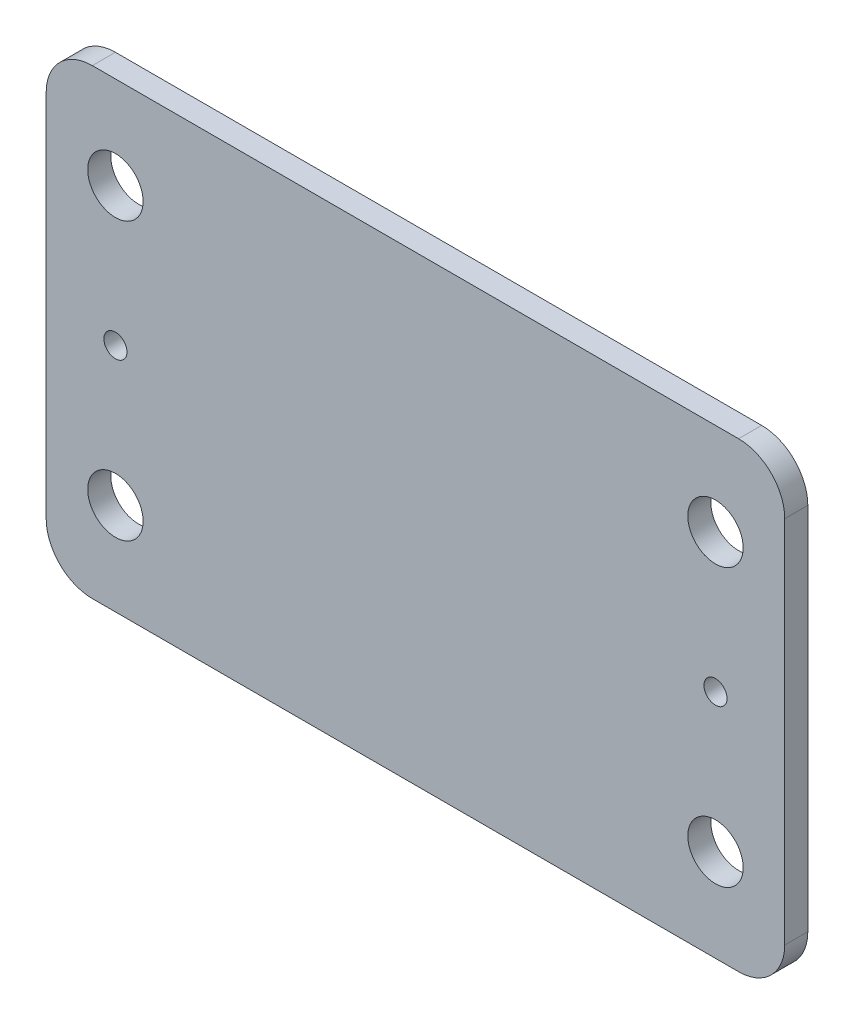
ISO-10303-21;
HEADER;
FILE_DESCRIPTION(('STEP AP214'),'2;1');
FILE_NAME('part.step','',(''),(''),'','','');
FILE_SCHEMA(('AUTOMOTIVE_DESIGN { 1 0 10303 214 1 1 1 1 }'));
ENDSEC;
DATA;
#1=APPLICATION_CONTEXT('core data for automotive mechanical design processes');
#2=APPLICATION_PROTOCOL_DEFINITION('international standard','automotive_design',2000,#1);
#3=PRODUCT_CONTEXT('',#1,'mechanical');
#4=PRODUCT('Part','Part','',(#3));
#5=PRODUCT_RELATED_PRODUCT_CATEGORY('part','',(#4));
#6=PRODUCT_DEFINITION_FORMATION('','',#4);
#7=PRODUCT_DEFINITION_CONTEXT('part definition',#1,'design');
#8=PRODUCT_DEFINITION('design','',#6,#7);
#9=PRODUCT_DEFINITION_SHAPE('','',#8);
#10=(LENGTH_UNIT() NAMED_UNIT(*) SI_UNIT(.MILLI.,.METRE.));
#11=(NAMED_UNIT(*) PLANE_ANGLE_UNIT() SI_UNIT($,.RADIAN.));
#12=(NAMED_UNIT(*) SI_UNIT($,.STERADIAN.) SOLID_ANGLE_UNIT());
#13=UNCERTAINTY_MEASURE_WITH_UNIT(LENGTH_MEASURE(1.E-05),#10,'distance_accuracy_value','');
#14=(GEOMETRIC_REPRESENTATION_CONTEXT(3) GLOBAL_UNCERTAINTY_ASSIGNED_CONTEXT((#13)) GLOBAL_UNIT_ASSIGNED_CONTEXT((#10,
#11,#12)) REPRESENTATION_CONTEXT('',''));
#15=CARTESIAN_POINT('',(0.,0.,0.));
#16=DIRECTION('',(0.,0.,1.));
#17=DIRECTION('',(1.,0.,0.));
#18=AXIS2_PLACEMENT_3D('',#15,#16,#17);
#19=CARTESIAN_POINT('',(0.,0.,5.));
#20=DIRECTION('',(1.,0.,0.));
#21=DIRECTION('',(0.,0.,-1.));
#22=AXIS2_PLACEMENT_3D('',#19,#20,#21);
#23=PLANE('',#22);
#24=DIRECTION('',(0.,-1.,0.));
#25=VECTOR('',#24,1.);
#26=CARTESIAN_POINT('',(0.,0.,0.));
#27=LINE('',#26,#25);
#28=CARTESIAN_POINT('',(0.,90.,0.));
#29=VERTEX_POINT('',#28);
#30=CARTESIAN_POINT('',(0.,10.,0.));
#31=VERTEX_POINT('',#30);
#32=EDGE_CURVE('E156',#29,#31,#27,.T.);
#33=ORIENTED_EDGE('',*,*,#32,.T.);
#34=DIRECTION('',(0.,0.,-1.));
#35=VECTOR('',#34,1.);
#36=CARTESIAN_POINT('',(0.,10.,5.));
#37=LINE('',#36,#35);
#38=CARTESIAN_POINT('',(0.,10.,5.));
#39=VERTEX_POINT('',#38);
#40=EDGE_CURVE('E131',#31,#39,#37,.F.);
#41=ORIENTED_EDGE('',*,*,#40,.T.);
#42=DIRECTION('',(0.,-1.,0.));
#43=VECTOR('',#42,1.);
#44=CARTESIAN_POINT('',(0.,0.,5.));
#45=LINE('',#44,#43);
#46=CARTESIAN_POINT('',(0.,90.,5.));
#47=VERTEX_POINT('',#46);
#48=EDGE_CURVE('E170',#47,#39,#45,.T.);
#49=ORIENTED_EDGE('',*,*,#48,.F.);
#50=DIRECTION('',(0.,0.,-1.));
#51=VECTOR('',#50,1.);
#52=CARTESIAN_POINT('',(0.,90.,5.));
#53=LINE('',#52,#51);
#54=EDGE_CURVE('E137',#47,#29,#53,.T.);
#55=ORIENTED_EDGE('',*,*,#54,.T.);
#56=EDGE_LOOP('',(#33,#41,#49,#55));
#57=FACE_BOUND('',#56,.T.);
#58=ADVANCED_FACE('F43',(#57),#23,.F.);
#59=CARTESIAN_POINT('',(0.,0.,5.));
#60=DIRECTION('',(0.,1.,0.));
#61=DIRECTION('',(0.,0.,1.));
#62=AXIS2_PLACEMENT_3D('',#59,#60,#61);
#63=PLANE('',#62);
#64=DIRECTION('',(1.,0.,0.));
#65=VECTOR('',#64,1.);
#66=CARTESIAN_POINT('',(0.,0.,5.));
#67=LINE('',#66,#65);
#68=CARTESIAN_POINT('',(10.,0.,5.));
#69=VERTEX_POINT('',#68);
#70=CARTESIAN_POINT('',(150.,0.,5.));
#71=VERTEX_POINT('',#70);
#72=EDGE_CURVE('E147',#69,#71,#67,.T.);
#73=ORIENTED_EDGE('',*,*,#72,.F.);
#74=DIRECTION('',(0.,0.,-1.));
#75=VECTOR('',#74,1.);
#76=CARTESIAN_POINT('',(10.,0.,5.));
#77=LINE('',#76,#75);
#78=CARTESIAN_POINT('',(10.,0.,0.));
#79=VERTEX_POINT('',#78);
#80=EDGE_CURVE('E130',#69,#79,#77,.T.);
#81=ORIENTED_EDGE('',*,*,#80,.T.);
#82=DIRECTION('',(1.,0.,0.));
#83=VECTOR('',#82,1.);
#84=CARTESIAN_POINT('',(0.,0.,0.));
#85=LINE('',#84,#83);
#86=CARTESIAN_POINT('',(150.,0.,0.));
#87=VERTEX_POINT('',#86);
#88=EDGE_CURVE('E144',#79,#87,#85,.T.);
#89=ORIENTED_EDGE('',*,*,#88,.T.);
#90=DIRECTION('',(0.,0.,-1.));
#91=VECTOR('',#90,1.);
#92=CARTESIAN_POINT('',(150.,0.,5.));
#93=LINE('',#92,#91);
#94=EDGE_CURVE('E150',#87,#71,#93,.F.);
#95=ORIENTED_EDGE('',*,*,#94,.T.);
#96=EDGE_LOOP('',(#73,#81,#89,#95));
#97=FACE_BOUND('',#96,.T.);
#98=ADVANCED_FACE('F143',(#97),#63,.F.);
#99=CARTESIAN_POINT('',(160.,0.,5.));
#100=DIRECTION('',(-1.,0.,0.));
#101=DIRECTION('',(0.,0.,1.));
#102=AXIS2_PLACEMENT_3D('',#99,#100,#101);
#103=PLANE('',#102);
#104=DIRECTION('',(0.,1.,0.));
#105=VECTOR('',#104,1.);
#106=CARTESIAN_POINT('',(160.,0.,5.));
#107=LINE('',#106,#105);
#108=CARTESIAN_POINT('',(160.,10.,5.));
#109=VERTEX_POINT('',#108);
#110=CARTESIAN_POINT('',(160.,90.,5.));
#111=VERTEX_POINT('',#110);
#112=EDGE_CURVE('E214',#109,#111,#107,.T.);
#113=ORIENTED_EDGE('',*,*,#112,.F.);
#114=DIRECTION('',(0.,0.,-1.));
#115=VECTOR('',#114,1.);
#116=CARTESIAN_POINT('',(160.,10.,5.));
#117=LINE('',#116,#115);
#118=CARTESIAN_POINT('',(160.,10.,0.));
#119=VERTEX_POINT('',#118);
#120=EDGE_CURVE('E199',#109,#119,#117,.T.);
#121=ORIENTED_EDGE('',*,*,#120,.T.);
#122=DIRECTION('',(0.,1.,0.));
#123=VECTOR('',#122,1.);
#124=CARTESIAN_POINT('',(160.,0.,0.));
#125=LINE('',#124,#123);
#126=CARTESIAN_POINT('',(160.,90.,0.));
#127=VERTEX_POINT('',#126);
#128=EDGE_CURVE('E155',#119,#127,#125,.T.);
#129=ORIENTED_EDGE('',*,*,#128,.T.);
#130=DIRECTION('',(0.,0.,-1.));
#131=VECTOR('',#130,1.);
#132=CARTESIAN_POINT('',(160.,90.,5.));
#133=LINE('',#132,#131);
#134=EDGE_CURVE('E196',#127,#111,#133,.F.);
#135=ORIENTED_EDGE('',*,*,#134,.T.);
#136=EDGE_LOOP('',(#113,#121,#129,#135));
#137=FACE_BOUND('',#136,.T.);
#138=ADVANCED_FACE('F267',(#137),#103,.F.);
#139=CARTESIAN_POINT('',(0.,100.,5.));
#140=DIRECTION('',(0.,-1.,0.));
#141=DIRECTION('',(0.,0.,-1.));
#142=AXIS2_PLACEMENT_3D('',#139,#140,#141);
#143=PLANE('',#142);
#144=DIRECTION('',(-1.,0.,0.));
#145=VECTOR('',#144,1.);
#146=CARTESIAN_POINT('',(0.,100.,5.));
#147=LINE('',#146,#145);
#148=CARTESIAN_POINT('',(150.,100.,5.));
#149=VERTEX_POINT('',#148);
#150=CARTESIAN_POINT('',(10.,100.,5.));
#151=VERTEX_POINT('',#150);
#152=EDGE_CURVE('E172',#149,#151,#147,.T.);
#153=ORIENTED_EDGE('',*,*,#152,.F.);
#154=DIRECTION('',(0.,0.,-1.));
#155=VECTOR('',#154,1.);
#156=CARTESIAN_POINT('',(150.,100.,5.));
#157=LINE('',#156,#155);
#158=CARTESIAN_POINT('',(150.,100.,0.));
#159=VERTEX_POINT('',#158);
#160=EDGE_CURVE('E11',#149,#159,#157,.T.);
#161=ORIENTED_EDGE('',*,*,#160,.T.);
#162=DIRECTION('',(-1.,0.,0.));
#163=VECTOR('',#162,1.);
#164=CARTESIAN_POINT('',(0.,100.,0.));
#165=LINE('',#164,#163);
#166=CARTESIAN_POINT('',(10.,100.,0.));
#167=VERTEX_POINT('',#166);
#168=EDGE_CURVE('E162',#159,#167,#165,.T.);
#169=ORIENTED_EDGE('',*,*,#168,.T.);
#170=DIRECTION('',(0.,0.,-1.));
#171=VECTOR('',#170,1.);
#172=CARTESIAN_POINT('',(10.,100.,5.));
#173=LINE('',#172,#171);
#174=EDGE_CURVE('E52',#167,#151,#173,.F.);
#175=ORIENTED_EDGE('',*,*,#174,.T.);
#176=EDGE_LOOP('',(#153,#161,#169,#175));
#177=FACE_BOUND('',#176,.T.);
#178=ADVANCED_FACE('F261',(#177),#143,.F.);
#179=CARTESIAN_POINT('',(0.,100.,5.));
#180=DIRECTION('',(0.,0.,-1.));
#181=DIRECTION('',(-1.,0.,0.));
#182=AXIS2_PLACEMENT_3D('',#179,#180,#181);
#183=PLANE('',#182);
#184=CARTESIAN_POINT('',(145.,50.,5.));
#185=DIRECTION('',(0.,0.,1.));
#186=DIRECTION('',(1.,0.,0.));
#187=AXIS2_PLACEMENT_3D('',#184,#185,#186);
#188=CIRCLE('',#187,2.5);
#189=CARTESIAN_POINT('',(147.5,50.,5.));
#190=VERTEX_POINT('',#189);
#191=EDGE_CURVE('E221',#190,#190,#188,.T.);
#192=ORIENTED_EDGE('',*,*,#191,.F.);
#193=EDGE_LOOP('',(#192));
#194=FACE_BOUND('',#193,.T.);
#195=CARTESIAN_POINT('',(15.,50.,5.));
#196=DIRECTION('',(0.,0.,1.));
#197=DIRECTION('',(1.,0.,0.));
#198=AXIS2_PLACEMENT_3D('',#195,#196,#197);
#199=CIRCLE('',#198,2.5);
#200=CARTESIAN_POINT('',(17.5,50.,5.));
#201=VERTEX_POINT('',#200);
#202=EDGE_CURVE('E220',#201,#201,#199,.T.);
#203=ORIENTED_EDGE('',*,*,#202,.F.);
#204=EDGE_LOOP('',(#203));
#205=FACE_BOUND('',#204,.T.);
#206=CARTESIAN_POINT('',(145.,20.,5.));
#207=DIRECTION('',(0.,0.,1.));
#208=DIRECTION('',(1.,0.,0.));
#209=AXIS2_PLACEMENT_3D('',#206,#207,#208);
#210=CIRCLE('',#209,6.00000000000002);
#211=CARTESIAN_POINT('',(151.,20.,5.));
#212=VERTEX_POINT('',#211);
#213=EDGE_CURVE('E208',#212,#212,#210,.T.);
#214=ORIENTED_EDGE('',*,*,#213,.F.);
#215=EDGE_LOOP('',(#214));
#216=FACE_BOUND('',#215,.T.);
#217=CARTESIAN_POINT('',(15.,20.,5.));
#218=DIRECTION('',(0.,0.,1.));
#219=DIRECTION('',(1.,0.,0.));
#220=AXIS2_PLACEMENT_3D('',#217,#218,#219);
#221=CIRCLE('',#220,6.);
#222=CARTESIAN_POINT('',(21.,20.,5.));
#223=VERTEX_POINT('',#222);
#224=EDGE_CURVE('E207',#223,#223,#221,.T.);
#225=ORIENTED_EDGE('',*,*,#224,.F.);
#226=EDGE_LOOP('',(#225));
#227=FACE_BOUND('',#226,.T.);
#228=CARTESIAN_POINT('',(145.,80.,5.));
#229=DIRECTION('',(0.,0.,1.));
#230=DIRECTION('',(1.,0.,0.));
#231=AXIS2_PLACEMENT_3D('',#228,#229,#230);
#232=CIRCLE('',#231,6.00000000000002);
#233=CARTESIAN_POINT('',(151.,80.,5.));
#234=VERTEX_POINT('',#233);
#235=EDGE_CURVE('E230',#234,#234,#232,.T.);
#236=ORIENTED_EDGE('',*,*,#235,.F.);
#237=EDGE_LOOP('',(#236));
#238=FACE_BOUND('',#237,.T.);
#239=CARTESIAN_POINT('',(15.,80.,5.));
#240=DIRECTION('',(0.,0.,1.));
#241=DIRECTION('',(1.,0.,0.));
#242=AXIS2_PLACEMENT_3D('',#239,#240,#241);
#243=CIRCLE('',#242,6.00000000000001);
#244=CARTESIAN_POINT('',(21.,80.,5.));
#245=VERTEX_POINT('',#244);
#246=EDGE_CURVE('E229',#245,#245,#243,.T.);
#247=ORIENTED_EDGE('',*,*,#246,.F.);
#248=EDGE_LOOP('',(#247));
#249=FACE_BOUND('',#248,.T.);
#250=ORIENTED_EDGE('',*,*,#48,.T.);
#251=CARTESIAN_POINT('',(10.,10.,5.));
#252=DIRECTION('',(0.,0.,-1.));
#253=DIRECTION('',(-1.,0.,0.));
#254=AXIS2_PLACEMENT_3D('',#251,#252,#253);
#255=CIRCLE('',#254,10.);
#256=EDGE_CURVE('E193',#39,#69,#255,.F.);
#257=ORIENTED_EDGE('',*,*,#256,.T.);
#258=ORIENTED_EDGE('',*,*,#72,.T.);
#259=CARTESIAN_POINT('',(150.,10.,5.));
#260=DIRECTION('',(0.,0.,-1.));
#261=DIRECTION('',(-1.,0.,0.));
#262=AXIS2_PLACEMENT_3D('',#259,#260,#261);
#263=CIRCLE('',#262,10.);
#264=EDGE_CURVE('E190',#71,#109,#263,.F.);
#265=ORIENTED_EDGE('',*,*,#264,.T.);
#266=ORIENTED_EDGE('',*,*,#112,.T.);
#267=CARTESIAN_POINT('',(150.,90.,5.));
#268=DIRECTION('',(0.,0.,-1.));
#269=DIRECTION('',(-1.,0.,0.));
#270=AXIS2_PLACEMENT_3D('',#267,#268,#269);
#271=CIRCLE('',#270,10.);
#272=EDGE_CURVE('E70',#111,#149,#271,.F.);
#273=ORIENTED_EDGE('',*,*,#272,.T.);
#274=ORIENTED_EDGE('',*,*,#152,.T.);
#275=CARTESIAN_POINT('',(10.,90.,5.));
#276=DIRECTION('',(0.,0.,-1.));
#277=DIRECTION('',(-1.,0.,0.));
#278=AXIS2_PLACEMENT_3D('',#275,#276,#277);
#279=CIRCLE('',#278,10.);
#280=EDGE_CURVE('E185',#151,#47,#279,.F.);
#281=ORIENTED_EDGE('',*,*,#280,.T.);
#282=EDGE_LOOP('',(#250,#257,#258,#265,#266,#273,#274,#281));
#283=FACE_BOUND('',#282,.T.);
#284=ADVANCED_FACE('F254',(#194,#205,#216,#227,#238,#249,#283),#183,.F.);
#285=CARTESIAN_POINT('',(0.,100.,0.));
#286=DIRECTION('',(0.,0.,-1.));
#287=DIRECTION('',(-1.,0.,0.));
#288=AXIS2_PLACEMENT_3D('',#285,#286,#287);
#289=PLANE('',#288);
#290=CARTESIAN_POINT('',(145.,50.,0.));
#291=DIRECTION('',(0.,0.,1.));
#292=DIRECTION('',(1.,0.,0.));
#293=AXIS2_PLACEMENT_3D('',#290,#291,#292);
#294=CIRCLE('',#293,2.5);
#295=CARTESIAN_POINT('',(147.5,50.,0.));
#296=VERTEX_POINT('',#295);
#297=EDGE_CURVE('E217',#296,#296,#294,.T.);
#298=ORIENTED_EDGE('',*,*,#297,.T.);
#299=EDGE_LOOP('',(#298));
#300=FACE_BOUND('',#299,.T.);
#301=CARTESIAN_POINT('',(15.,50.,0.));
#302=DIRECTION('',(0.,0.,1.));
#303=DIRECTION('',(1.,0.,0.));
#304=AXIS2_PLACEMENT_3D('',#301,#302,#303);
#305=CIRCLE('',#304,2.5);
#306=CARTESIAN_POINT('',(17.5,50.,0.));
#307=VERTEX_POINT('',#306);
#308=EDGE_CURVE('E211',#307,#307,#305,.T.);
#309=ORIENTED_EDGE('',*,*,#308,.T.);
#310=EDGE_LOOP('',(#309));
#311=FACE_BOUND('',#310,.T.);
#312=CARTESIAN_POINT('',(145.,20.,0.));
#313=DIRECTION('',(0.,0.,1.));
#314=DIRECTION('',(1.,0.,0.));
#315=AXIS2_PLACEMENT_3D('',#312,#313,#314);
#316=CIRCLE('',#315,6.00000000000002);
#317=CARTESIAN_POINT('',(151.,20.,0.));
#318=VERTEX_POINT('',#317);
#319=EDGE_CURVE('E204',#318,#318,#316,.T.);
#320=ORIENTED_EDGE('',*,*,#319,.T.);
#321=EDGE_LOOP('',(#320));
#322=FACE_BOUND('',#321,.T.);
#323=CARTESIAN_POINT('',(15.,20.,0.));
#324=DIRECTION('',(0.,0.,1.));
#325=DIRECTION('',(1.,0.,0.));
#326=AXIS2_PLACEMENT_3D('',#323,#324,#325);
#327=CIRCLE('',#326,6.);
#328=CARTESIAN_POINT('',(21.,20.,0.));
#329=VERTEX_POINT('',#328);
#330=EDGE_CURVE('E233',#329,#329,#327,.T.);
#331=ORIENTED_EDGE('',*,*,#330,.T.);
#332=EDGE_LOOP('',(#331));
#333=FACE_BOUND('',#332,.T.);
#334=CARTESIAN_POINT('',(145.,80.,0.));
#335=DIRECTION('',(0.,0.,1.));
#336=DIRECTION('',(1.,0.,0.));
#337=AXIS2_PLACEMENT_3D('',#334,#335,#336);
#338=CIRCLE('',#337,6.00000000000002);
#339=CARTESIAN_POINT('',(151.,80.,0.));
#340=VERTEX_POINT('',#339);
#341=EDGE_CURVE('E226',#340,#340,#338,.T.);
#342=ORIENTED_EDGE('',*,*,#341,.T.);
#343=EDGE_LOOP('',(#342));
#344=FACE_BOUND('',#343,.T.);
#345=CARTESIAN_POINT('',(15.,80.,0.));
#346=DIRECTION('',(0.,0.,1.));
#347=DIRECTION('',(1.,0.,0.));
#348=AXIS2_PLACEMENT_3D('',#345,#346,#347);
#349=CIRCLE('',#348,6.00000000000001);
#350=CARTESIAN_POINT('',(21.,80.,0.));
#351=VERTEX_POINT('',#350);
#352=EDGE_CURVE('E164',#351,#351,#349,.T.);
#353=ORIENTED_EDGE('',*,*,#352,.T.);
#354=EDGE_LOOP('',(#353));
#355=FACE_BOUND('',#354,.T.);
#356=ORIENTED_EDGE('',*,*,#88,.F.);
#357=CARTESIAN_POINT('',(10.,10.,0.));
#358=DIRECTION('',(0.,0.,-1.));
#359=DIRECTION('',(-1.,0.,0.));
#360=AXIS2_PLACEMENT_3D('',#357,#358,#359);
#361=CIRCLE('',#360,10.);
#362=EDGE_CURVE('E126',#79,#31,#361,.T.);
#363=ORIENTED_EDGE('',*,*,#362,.T.);
#364=ORIENTED_EDGE('',*,*,#32,.F.);
#365=CARTESIAN_POINT('',(10.,90.,0.));
#366=DIRECTION('',(0.,0.,-1.));
#367=DIRECTION('',(-1.,0.,0.));
#368=AXIS2_PLACEMENT_3D('',#365,#366,#367);
#369=CIRCLE('',#368,10.);
#370=EDGE_CURVE('E149',#29,#167,#369,.T.);
#371=ORIENTED_EDGE('',*,*,#370,.T.);
#372=ORIENTED_EDGE('',*,*,#168,.F.);
#373=CARTESIAN_POINT('',(150.,90.,0.));
#374=DIRECTION('',(0.,0.,-1.));
#375=DIRECTION('',(-1.,0.,0.));
#376=AXIS2_PLACEMENT_3D('',#373,#374,#375);
#377=CIRCLE('',#376,10.);
#378=EDGE_CURVE('E176',#159,#127,#377,.T.);
#379=ORIENTED_EDGE('',*,*,#378,.T.);
#380=ORIENTED_EDGE('',*,*,#128,.F.);
#381=CARTESIAN_POINT('',(150.,10.,0.));
#382=DIRECTION('',(0.,0.,-1.));
#383=DIRECTION('',(-1.,0.,0.));
#384=AXIS2_PLACEMENT_3D('',#381,#382,#383);
#385=CIRCLE('',#384,10.);
#386=EDGE_CURVE('E138',#119,#87,#385,.T.);
#387=ORIENTED_EDGE('',*,*,#386,.T.);
#388=EDGE_LOOP('',(#356,#363,#364,#371,#372,#379,#380,#387));
#389=FACE_BOUND('',#388,.T.);
#390=ADVANCED_FACE('F152',(#300,#311,#322,#333,#344,#355,#389),#289,.T.);
#391=CARTESIAN_POINT('',(15.,80.,0.));
#392=DIRECTION('',(0.,0.,1.));
#393=DIRECTION('',(1.,0.,0.));
#394=AXIS2_PLACEMENT_3D('',#391,#392,#393);
#395=CYLINDRICAL_SURFACE('',#394,6.00000000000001);
#396=ORIENTED_EDGE('',*,*,#352,.F.);
#397=EDGE_LOOP('',(#396));
#398=FACE_BOUND('',#397,.T.);
#399=ORIENTED_EDGE('',*,*,#246,.T.);
#400=EDGE_LOOP('',(#399));
#401=FACE_BOUND('',#400,.T.);
#402=ADVANCED_FACE('F293',(#398,#401),#395,.F.);
#403=CARTESIAN_POINT('',(145.,80.,0.));
#404=DIRECTION('',(0.,0.,1.));
#405=DIRECTION('',(1.,0.,0.));
#406=AXIS2_PLACEMENT_3D('',#403,#404,#405);
#407=CYLINDRICAL_SURFACE('',#406,6.00000000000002);
#408=ORIENTED_EDGE('',*,*,#341,.F.);
#409=EDGE_LOOP('',(#408));
#410=FACE_BOUND('',#409,.T.);
#411=ORIENTED_EDGE('',*,*,#235,.T.);
#412=EDGE_LOOP('',(#411));
#413=FACE_BOUND('',#412,.T.);
#414=ADVANCED_FACE('F300',(#410,#413),#407,.F.);
#415=CARTESIAN_POINT('',(15.,20.,0.));
#416=DIRECTION('',(0.,0.,1.));
#417=DIRECTION('',(1.,0.,0.));
#418=AXIS2_PLACEMENT_3D('',#415,#416,#417);
#419=CYLINDRICAL_SURFACE('',#418,6.);
#420=ORIENTED_EDGE('',*,*,#330,.F.);
#421=EDGE_LOOP('',(#420));
#422=FACE_BOUND('',#421,.T.);
#423=ORIENTED_EDGE('',*,*,#224,.T.);
#424=EDGE_LOOP('',(#423));
#425=FACE_BOUND('',#424,.T.);
#426=ADVANCED_FACE('F304',(#422,#425),#419,.F.);
#427=CARTESIAN_POINT('',(145.,20.,0.));
#428=DIRECTION('',(0.,0.,1.));
#429=DIRECTION('',(1.,0.,0.));
#430=AXIS2_PLACEMENT_3D('',#427,#428,#429);
#431=CYLINDRICAL_SURFACE('',#430,6.00000000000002);
#432=ORIENTED_EDGE('',*,*,#319,.F.);
#433=EDGE_LOOP('',(#432));
#434=FACE_BOUND('',#433,.T.);
#435=ORIENTED_EDGE('',*,*,#213,.T.);
#436=EDGE_LOOP('',(#435));
#437=FACE_BOUND('',#436,.T.);
#438=ADVANCED_FACE('F278',(#434,#437),#431,.F.);
#439=CARTESIAN_POINT('',(10.,10.,5.));
#440=DIRECTION('',(0.,0.,-1.));
#441=DIRECTION('',(-1.,0.,0.));
#442=AXIS2_PLACEMENT_3D('',#439,#440,#441);
#443=CYLINDRICAL_SURFACE('',#442,10.);
#444=ORIENTED_EDGE('',*,*,#256,.F.);
#445=ORIENTED_EDGE('',*,*,#40,.F.);
#446=ORIENTED_EDGE('',*,*,#362,.F.);
#447=ORIENTED_EDGE('',*,*,#80,.F.);
#448=EDGE_LOOP('',(#444,#445,#446,#447));
#449=FACE_BOUND('',#448,.T.);
#450=ADVANCED_FACE('F129',(#449),#443,.T.);
#451=CARTESIAN_POINT('',(150.,10.,5.));
#452=DIRECTION('',(0.,0.,-1.));
#453=DIRECTION('',(-1.,0.,0.));
#454=AXIS2_PLACEMENT_3D('',#451,#452,#453);
#455=CYLINDRICAL_SURFACE('',#454,10.);
#456=ORIENTED_EDGE('',*,*,#264,.F.);
#457=ORIENTED_EDGE('',*,*,#94,.F.);
#458=ORIENTED_EDGE('',*,*,#386,.F.);
#459=ORIENTED_EDGE('',*,*,#120,.F.);
#460=EDGE_LOOP('',(#456,#457,#458,#459));
#461=FACE_BOUND('',#460,.T.);
#462=ADVANCED_FACE('F271',(#461),#455,.T.);
#463=CARTESIAN_POINT('',(150.,90.,5.));
#464=DIRECTION('',(0.,0.,-1.));
#465=DIRECTION('',(-1.,0.,0.));
#466=AXIS2_PLACEMENT_3D('',#463,#464,#465);
#467=CYLINDRICAL_SURFACE('',#466,10.);
#468=ORIENTED_EDGE('',*,*,#272,.F.);
#469=ORIENTED_EDGE('',*,*,#134,.F.);
#470=ORIENTED_EDGE('',*,*,#378,.F.);
#471=ORIENTED_EDGE('',*,*,#160,.F.);
#472=EDGE_LOOP('',(#468,#469,#470,#471));
#473=FACE_BOUND('',#472,.T.);
#474=ADVANCED_FACE('F263',(#473),#467,.T.);
#475=CARTESIAN_POINT('',(10.,90.,5.));
#476=DIRECTION('',(0.,0.,-1.));
#477=DIRECTION('',(-1.,0.,0.));
#478=AXIS2_PLACEMENT_3D('',#475,#476,#477);
#479=CYLINDRICAL_SURFACE('',#478,10.);
#480=ORIENTED_EDGE('',*,*,#280,.F.);
#481=ORIENTED_EDGE('',*,*,#174,.F.);
#482=ORIENTED_EDGE('',*,*,#370,.F.);
#483=ORIENTED_EDGE('',*,*,#54,.F.);
#484=EDGE_LOOP('',(#480,#481,#482,#483));
#485=FACE_BOUND('',#484,.T.);
#486=ADVANCED_FACE('F45',(#485),#479,.T.);
#487=CARTESIAN_POINT('',(15.,50.,0.));
#488=DIRECTION('',(0.,0.,1.));
#489=DIRECTION('',(1.,0.,0.));
#490=AXIS2_PLACEMENT_3D('',#487,#488,#489);
#491=CYLINDRICAL_SURFACE('',#490,2.5);
#492=ORIENTED_EDGE('',*,*,#308,.F.);
#493=EDGE_LOOP('',(#492));
#494=FACE_BOUND('',#493,.T.);
#495=ORIENTED_EDGE('',*,*,#202,.T.);
#496=EDGE_LOOP('',(#495));
#497=FACE_BOUND('',#496,.T.);
#498=ADVANCED_FACE('F312',(#494,#497),#491,.F.);
#499=CARTESIAN_POINT('',(145.,50.,0.));
#500=DIRECTION('',(0.,0.,1.));
#501=DIRECTION('',(1.,0.,0.));
#502=AXIS2_PLACEMENT_3D('',#499,#500,#501);
#503=CYLINDRICAL_SURFACE('',#502,2.5);
#504=ORIENTED_EDGE('',*,*,#297,.F.);
#505=EDGE_LOOP('',(#504));
#506=FACE_BOUND('',#505,.T.);
#507=ORIENTED_EDGE('',*,*,#191,.T.);
#508=EDGE_LOOP('',(#507));
#509=FACE_BOUND('',#508,.T.);
#510=ADVANCED_FACE('F315',(#506,#509),#503,.F.);
#511=CLOSED_SHELL('',(#58,#98,#138,#178,#284,#390,#402,#414,#426,#438,#450,#462,#474,#486,#498,#510));
#512=MANIFOLD_SOLID_BREP('B2',#511);
#513=ADVANCED_BREP_SHAPE_REPRESENTATION('',(#18,#512),#14);
#514=SHAPE_DEFINITION_REPRESENTATION(#9,#513);
ENDSEC;
END-ISO-10303-21;
